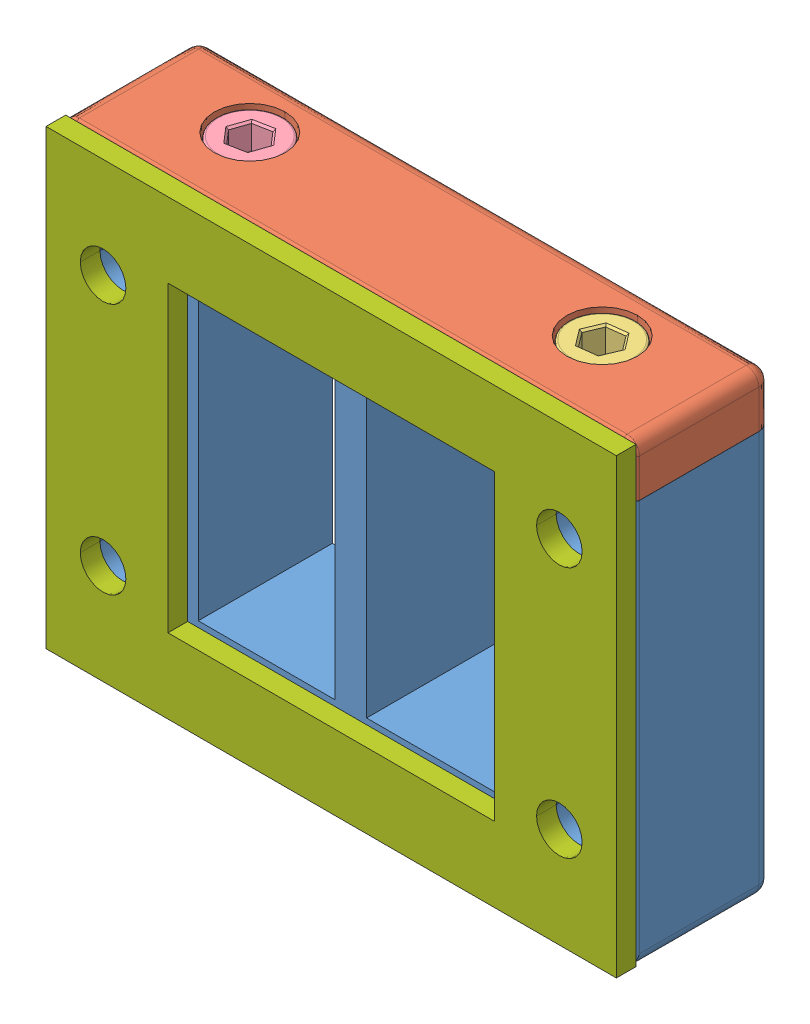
SolidWorks assembly 70008_200.SLDASM, configuration Default (file format 8000). Lengths in mm.
Overall size (72.82 58 19.55).
7 component instances, 7 part files, 0 mates.
Components (placement in the parent):
- 70008_200_01-1: 70008_200_01.SLDPRT [Default] at origin size (72.82 51.5 17.06)
- 70008_200_02-1: 70008_200_02.SLDPRT [Default] at origin size (72.8 10.49 17.05)
- 70008_200_03-1: 70008_200_03.SLDPRT [Default] at origin size (8.5 57 8.5)
- 70008_200_04-1: 70008_200_04.SLDPRT [Default] at origin size (8.5 57 8.5)
- 70008_200_05-1: 70008_200_05.SLDPRT [Default] at origin size (9.25 4.7 8.01)
- 70008_200_06-1: 70008_200_06.SLDPRT [Default] at origin size (9.25 4.7 8.01)
- 70008_200_07-1: 70008_200_07.SLDPRT [Default] at origin size (72.5 57.5 2.5)
